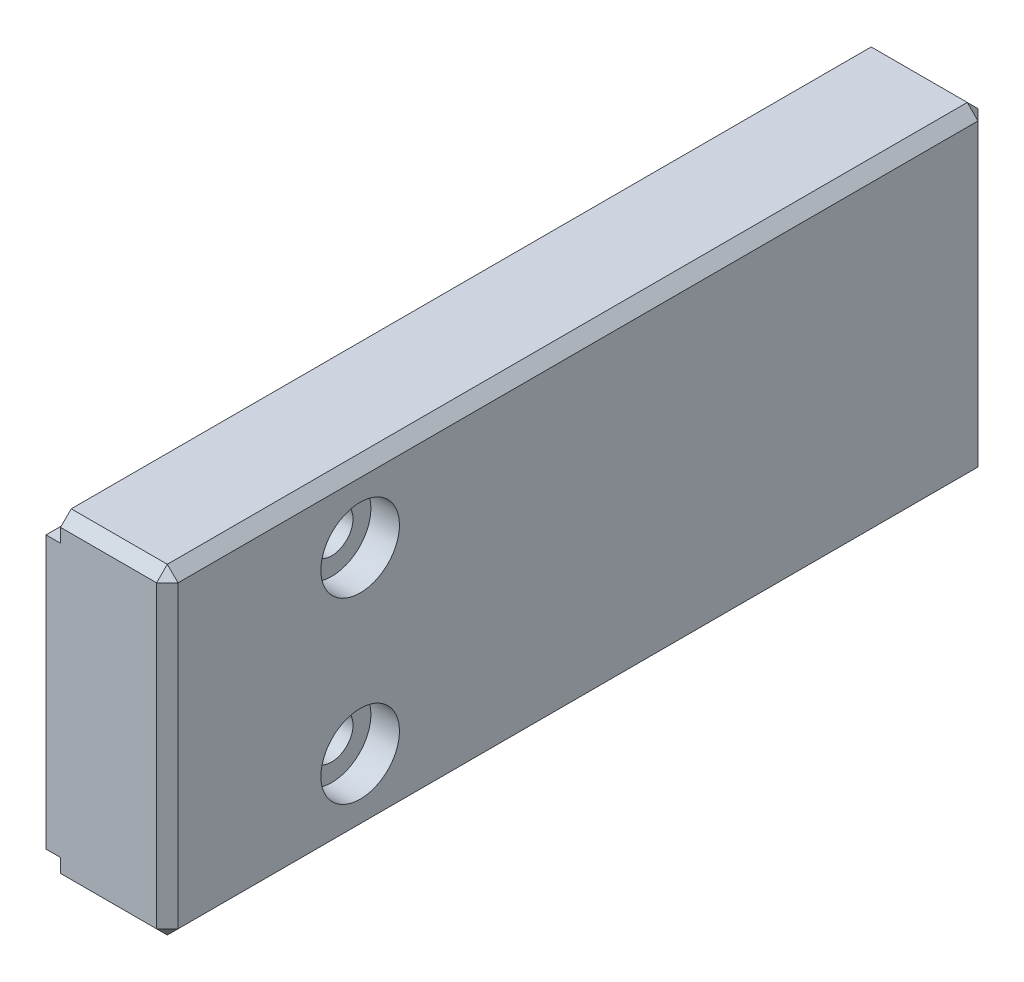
ISO-10303-21;
HEADER;
FILE_DESCRIPTION(('STEP AP214'),'2;1');
FILE_NAME('part.step','',(''),(''),'','','');
FILE_SCHEMA(('AUTOMOTIVE_DESIGN { 1 0 10303 214 1 1 1 1 }'));
ENDSEC;
DATA;
#1=APPLICATION_CONTEXT('core data for automotive mechanical design processes');
#2=APPLICATION_PROTOCOL_DEFINITION('international standard','automotive_design',2000,#1);
#3=PRODUCT_CONTEXT('',#1,'mechanical');
#4=PRODUCT('Part','Part','',(#3));
#5=PRODUCT_RELATED_PRODUCT_CATEGORY('part','',(#4));
#6=PRODUCT_DEFINITION_FORMATION('','',#4);
#7=PRODUCT_DEFINITION_CONTEXT('part definition',#1,'design');
#8=PRODUCT_DEFINITION('design','',#6,#7);
#9=PRODUCT_DEFINITION_SHAPE('','',#8);
#10=(LENGTH_UNIT() NAMED_UNIT(*) SI_UNIT(.MILLI.,.METRE.));
#11=(NAMED_UNIT(*) PLANE_ANGLE_UNIT() SI_UNIT($,.RADIAN.));
#12=(NAMED_UNIT(*) SI_UNIT($,.STERADIAN.) SOLID_ANGLE_UNIT());
#13=UNCERTAINTY_MEASURE_WITH_UNIT(LENGTH_MEASURE(1.E-05),#10,'distance_accuracy_value','');
#14=(GEOMETRIC_REPRESENTATION_CONTEXT(3) GLOBAL_UNCERTAINTY_ASSIGNED_CONTEXT((#13)) GLOBAL_UNIT_ASSIGNED_CONTEXT((#10,
#11,#12)) REPRESENTATION_CONTEXT('',''));
#15=CARTESIAN_POINT('',(0.,0.,0.));
#16=DIRECTION('',(0.,0.,1.));
#17=DIRECTION('',(1.,0.,0.));
#18=AXIS2_PLACEMENT_3D('',#15,#16,#17);
#19=CARTESIAN_POINT('',(-2.03200000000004,7.621,-40.512));
#20=DIRECTION('',(1.,0.,0.));
#21=DIRECTION('',(0.,0.,-1.));
#22=AXIS2_PLACEMENT_3D('',#19,#20,#21);
#23=CYLINDRICAL_SURFACE('',#22,8.00000000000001);
#24=DIRECTION('',(1.,0.,0.));
#25=VECTOR('',#24,1.);
#26=CARTESIAN_POINT('',(-2.03200000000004,7.621,-32.512));
#27=LINE('',#26,#25);
#28=CARTESIAN_POINT('',(7.96799999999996,7.621,-32.512));
#29=VERTEX_POINT('',#28);
#30=CARTESIAN_POINT('',(-2.03200000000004,7.621,-32.512));
#31=VERTEX_POINT('',#30);
#32=EDGE_CURVE('E156',#29,#31,#27,.F.);
#33=ORIENTED_EDGE('',*,*,#32,.T.);
#34=CARTESIAN_POINT('',(-2.03200000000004,7.621,-40.512));
#35=DIRECTION('',(1.,0.,0.));
#36=DIRECTION('',(0.,0.,-1.));
#37=AXIS2_PLACEMENT_3D('',#34,#35,#36);
#38=CIRCLE('',#37,8.00000000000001);
#39=CARTESIAN_POINT('',(-2.03200000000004,15.621,-40.512));
#40=VERTEX_POINT('',#39);
#41=EDGE_CURVE('E237',#40,#31,#38,.T.);
#42=ORIENTED_EDGE('',*,*,#41,.F.);
#43=DIRECTION('',(1.,0.,0.));
#44=VECTOR('',#43,1.);
#45=CARTESIAN_POINT('',(-2.03200000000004,15.621,-40.512));
#46=LINE('',#45,#44);
#47=CARTESIAN_POINT('',(7.96799999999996,15.621,-40.512));
#48=VERTEX_POINT('',#47);
#49=EDGE_CURVE('E152',#40,#48,#46,.T.);
#50=ORIENTED_EDGE('',*,*,#49,.T.);
#51=CARTESIAN_POINT('',(7.96799999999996,7.621,-40.512));
#52=DIRECTION('',(1.,0.,0.));
#53=DIRECTION('',(0.,0.,-1.));
#54=AXIS2_PLACEMENT_3D('',#51,#52,#53);
#55=CIRCLE('',#54,8.00000000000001);
#56=EDGE_CURVE('E20',#48,#29,#55,.T.);
#57=ORIENTED_EDGE('',*,*,#56,.T.);
#58=EDGE_LOOP('',(#33,#42,#50,#57));
#59=FACE_BOUND('',#58,.T.);
#60=ADVANCED_FACE('F16',(#59),#23,.F.);
#61=CARTESIAN_POINT('',(-2.03200000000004,-7.621,-32.512));
#62=DIRECTION('',(0.,0.,1.));
#63=DIRECTION('',(1.,0.,0.));
#64=AXIS2_PLACEMENT_3D('',#61,#62,#63);
#65=PLANE('',#64);
#66=DIRECTION('',(1.,0.,0.));
#67=VECTOR('',#66,1.);
#68=CARTESIAN_POINT('',(-2.03200000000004,-7.621,-32.512));
#69=LINE('',#68,#67);
#70=CARTESIAN_POINT('',(7.96799999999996,-7.621,-32.512));
#71=VERTEX_POINT('',#70);
#72=CARTESIAN_POINT('',(-2.03200000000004,-7.621,-32.512));
#73=VERTEX_POINT('',#72);
#74=EDGE_CURVE('E169',#71,#73,#69,.F.);
#75=ORIENTED_EDGE('',*,*,#74,.T.);
#76=DIRECTION('',(0.,1.,0.));
#77=VECTOR('',#76,1.);
#78=CARTESIAN_POINT('',(-2.03200000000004,-4.191,-32.512));
#79=LINE('',#78,#77);
#80=EDGE_CURVE('E167',#31,#73,#79,.F.);
#81=ORIENTED_EDGE('',*,*,#80,.F.);
#82=ORIENTED_EDGE('',*,*,#32,.F.);
#83=DIRECTION('',(0.,1.,0.));
#84=VECTOR('',#83,1.);
#85=CARTESIAN_POINT('',(7.96799999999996,0.,-32.512));
#86=LINE('',#85,#84);
#87=EDGE_CURVE('E161',#29,#71,#86,.F.);
#88=ORIENTED_EDGE('',*,*,#87,.T.);
#89=EDGE_LOOP('',(#75,#81,#82,#88));
#90=FACE_BOUND('',#89,.T.);
#91=ADVANCED_FACE('F164',(#90),#65,.F.);
#92=CARTESIAN_POINT('',(-2.03200000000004,-7.621,-40.512));
#93=DIRECTION('',(1.,0.,0.));
#94=DIRECTION('',(0.,0.,-1.));
#95=AXIS2_PLACEMENT_3D('',#92,#93,#94);
#96=CYLINDRICAL_SURFACE('',#95,8.);
#97=DIRECTION('',(1.,0.,0.));
#98=VECTOR('',#97,1.);
#99=CARTESIAN_POINT('',(-2.03200000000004,-15.621,-40.512));
#100=LINE('',#99,#98);
#101=CARTESIAN_POINT('',(7.96799999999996,-15.621,-40.512));
#102=VERTEX_POINT('',#101);
#103=CARTESIAN_POINT('',(-2.03200000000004,-15.621,-40.512));
#104=VERTEX_POINT('',#103);
#105=EDGE_CURVE('E176',#102,#104,#100,.F.);
#106=ORIENTED_EDGE('',*,*,#105,.T.);
#107=CARTESIAN_POINT('',(-2.03200000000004,-7.621,-40.512));
#108=DIRECTION('',(1.,0.,0.));
#109=DIRECTION('',(0.,0.,-1.));
#110=AXIS2_PLACEMENT_3D('',#107,#108,#109);
#111=CIRCLE('',#110,8.);
#112=EDGE_CURVE('E233',#73,#104,#111,.T.);
#113=ORIENTED_EDGE('',*,*,#112,.F.);
#114=ORIENTED_EDGE('',*,*,#74,.F.);
#115=CARTESIAN_POINT('',(7.96799999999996,-7.621,-40.512));
#116=DIRECTION('',(1.,0.,0.));
#117=DIRECTION('',(0.,0.,-1.));
#118=AXIS2_PLACEMENT_3D('',#115,#116,#117);
#119=CIRCLE('',#118,8.);
#120=EDGE_CURVE('E174',#71,#102,#119,.T.);
#121=ORIENTED_EDGE('',*,*,#120,.T.);
#122=EDGE_LOOP('',(#106,#113,#114,#121));
#123=FACE_BOUND('',#122,.T.);
#124=ADVANCED_FACE('F540',(#123),#96,.F.);
#125=CARTESIAN_POINT('',(10.7631428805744,21.729,-0.75));
#126=DIRECTION('',(0.,0.707106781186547,0.707106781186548));
#127=DIRECTION('',(0.,-0.707106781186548,0.707106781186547));
#128=AXIS2_PLACEMENT_3D('',#125,#126,#127);
#129=PLANE('',#128);
#130=DIRECTION('',(0.,-0.707106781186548,0.707106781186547));
#131=VECTOR('',#130,1.);
#132=CARTESIAN_POINT('',(13.4532,21.354,-0.375000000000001));
#133=LINE('',#132,#131);
#134=CARTESIAN_POINT('',(13.4532,22.479,-1.5));
#135=VERTEX_POINT('',#134);
#136=CARTESIAN_POINT('',(13.4532,20.979,0.));
#137=VERTEX_POINT('',#136);
#138=EDGE_CURVE('E284',#135,#137,#133,.T.);
#139=ORIENTED_EDGE('',*,*,#138,.F.);
#140=DIRECTION('',(1.,0.,0.));
#141=VECTOR('',#140,1.);
#142=CARTESIAN_POINT('',(14.9532,22.479,-1.5));
#143=LINE('',#142,#141);
#144=CARTESIAN_POINT('',(0.,22.479,-1.5));
#145=VERTEX_POINT('',#144);
#146=EDGE_CURVE('E228',#145,#135,#143,.T.);
#147=ORIENTED_EDGE('',*,*,#146,.F.);
#148=DIRECTION('',(0.,0.707106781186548,-0.707106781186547));
#149=VECTOR('',#148,1.);
#150=CARTESIAN_POINT('',(0.,20.979,0.));
#151=LINE('',#150,#149);
#152=CARTESIAN_POINT('',(0.,20.979,0.));
#153=VERTEX_POINT('',#152);
#154=EDGE_CURVE('E185',#153,#145,#151,.T.);
#155=ORIENTED_EDGE('',*,*,#154,.F.);
#156=DIRECTION('',(1.,0.,0.));
#157=VECTOR('',#156,1.);
#158=CARTESIAN_POINT('',(6.57308576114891,20.979,0.));
#159=LINE('',#158,#157);
#160=EDGE_CURVE('E287',#137,#153,#159,.F.);
#161=ORIENTED_EDGE('',*,*,#160,.F.);
#162=EDGE_LOOP('',(#139,#147,#155,#161));
#163=FACE_BOUND('',#162,.T.);
#164=ADVANCED_FACE('F432',(#163),#129,.T.);
#165=CARTESIAN_POINT('',(3.28654288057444,-21.729,-0.75));
#166=DIRECTION('',(0.,-0.707106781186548,0.707106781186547));
#167=DIRECTION('',(0.,-0.707106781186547,-0.707106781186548));
#168=AXIS2_PLACEMENT_3D('',#165,#166,#167);
#169=PLANE('',#168);
#170=DIRECTION('',(0.,-0.707106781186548,-0.707106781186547));
#171=VECTOR('',#170,1.);
#172=CARTESIAN_POINT('',(13.4532,-20.979,0.));
#173=LINE('',#172,#171);
#174=CARTESIAN_POINT('',(13.4532,-20.979,0.));
#175=VERTEX_POINT('',#174);
#176=CARTESIAN_POINT('',(13.4532,-22.479,-1.5));
#177=VERTEX_POINT('',#176);
#178=EDGE_CURVE('E308',#175,#177,#173,.T.);
#179=ORIENTED_EDGE('',*,*,#178,.F.);
#180=DIRECTION('',(1.,0.,0.));
#181=VECTOR('',#180,1.);
#182=CARTESIAN_POINT('',(6.57308576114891,-20.979,0.));
#183=LINE('',#182,#181);
#184=CARTESIAN_POINT('',(0.,-20.979,0.));
#185=VERTEX_POINT('',#184);
#186=EDGE_CURVE('E305',#185,#175,#183,.T.);
#187=ORIENTED_EDGE('',*,*,#186,.F.);
#188=DIRECTION('',(0.,0.707106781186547,0.707106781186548));
#189=VECTOR('',#188,1.);
#190=CARTESIAN_POINT('',(0.,-22.479,-1.5));
#191=LINE('',#190,#189);
#192=CARTESIAN_POINT('',(0.,-22.479,-1.5));
#193=VERTEX_POINT('',#192);
#194=EDGE_CURVE('E267',#193,#185,#191,.T.);
#195=ORIENTED_EDGE('',*,*,#194,.F.);
#196=DIRECTION('',(1.,0.,0.));
#197=VECTOR('',#196,1.);
#198=CARTESIAN_POINT('',(0.,-22.479,-1.5));
#199=LINE('',#198,#197);
#200=EDGE_CURVE('E311',#177,#193,#199,.F.);
#201=ORIENTED_EDGE('',*,*,#200,.F.);
#202=EDGE_LOOP('',(#179,#187,#195,#201));
#203=FACE_BOUND('',#202,.T.);
#204=ADVANCED_FACE('F436',(#203),#169,.T.);
#205=CARTESIAN_POINT('',(0.,22.479,0.));
#206=DIRECTION('',(-1.,0.,0.));
#207=DIRECTION('',(0.,0.,1.));
#208=AXIS2_PLACEMENT_3D('',#205,#206,#207);
#209=PLANE('',#208);
#210=DIRECTION('',(0.,0.,1.));
#211=VECTOR('',#210,1.);
#212=CARTESIAN_POINT('',(0.,19.05,0.));
#213=LINE('',#212,#211);
#214=CARTESIAN_POINT('',(0.,19.05,0.));
#215=VERTEX_POINT('',#214);
#216=CARTESIAN_POINT('',(0.,19.05,-115.));
#217=VERTEX_POINT('',#216);
#218=EDGE_CURVE('E182',#215,#217,#213,.F.);
#219=ORIENTED_EDGE('',*,*,#218,.F.);
#220=DIRECTION('',(0.,1.,0.));
#221=VECTOR('',#220,1.);
#222=CARTESIAN_POINT('',(0.,0.,0.));
#223=LINE('',#222,#221);
#224=EDGE_CURVE('E290',#153,#215,#223,.F.);
#225=ORIENTED_EDGE('',*,*,#224,.F.);
#226=ORIENTED_EDGE('',*,*,#154,.T.);
#227=DIRECTION('',(0.,0.,1.));
#228=VECTOR('',#227,1.);
#229=CARTESIAN_POINT('',(0.,22.479,0.));
#230=LINE('',#229,#228);
#231=CARTESIAN_POINT('',(0.,22.479,-113.5));
#232=VERTEX_POINT('',#231);
#233=EDGE_CURVE('E281',#232,#145,#230,.T.);
#234=ORIENTED_EDGE('',*,*,#233,.F.);
#235=DIRECTION('',(0.,0.707106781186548,0.707106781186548));
#236=VECTOR('',#235,1.);
#237=CARTESIAN_POINT('',(0.,21.729,-114.25));
#238=LINE('',#237,#236);
#239=CARTESIAN_POINT('',(0.,20.979,-115.));
#240=VERTEX_POINT('',#239);
#241=EDGE_CURVE('E232',#240,#232,#238,.T.);
#242=ORIENTED_EDGE('',*,*,#241,.F.);
#243=DIRECTION('',(0.,1.,0.));
#244=VECTOR('',#243,1.);
#245=CARTESIAN_POINT('',(0.,0.,-115.));
#246=LINE('',#245,#244);
#247=EDGE_CURVE('E325',#240,#217,#246,.F.);
#248=ORIENTED_EDGE('',*,*,#247,.T.);
#249=EDGE_LOOP('',(#219,#225,#226,#234,#242,#248));
#250=FACE_BOUND('',#249,.T.);
#251=ADVANCED_FACE('F430',(#250),#209,.T.);
#252=CARTESIAN_POINT('',(0.,19.05,0.));
#253=DIRECTION('',(0.,1.,0.));
#254=DIRECTION('',(0.,0.,1.));
#255=AXIS2_PLACEMENT_3D('',#252,#253,#254);
#256=PLANE('',#255);
#257=DIRECTION('',(1.,0.,0.));
#258=VECTOR('',#257,1.);
#259=CARTESIAN_POINT('',(6.57308576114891,19.05,0.));
#260=LINE('',#259,#258);
#261=CARTESIAN_POINT('',(-2.03200000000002,19.05,0.));
#262=VERTEX_POINT('',#261);
#263=EDGE_CURVE('E293',#215,#262,#260,.F.);
#264=ORIENTED_EDGE('',*,*,#263,.F.);
#265=ORIENTED_EDGE('',*,*,#218,.T.);
#266=DIRECTION('',(1.,0.,0.));
#267=VECTOR('',#266,1.);
#268=CARTESIAN_POINT('',(6.57308576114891,19.05,-115.));
#269=LINE('',#268,#267);
#270=CARTESIAN_POINT('',(-2.03200000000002,19.05,-115.));
#271=VERTEX_POINT('',#270);
#272=EDGE_CURVE('E202',#217,#271,#269,.F.);
#273=ORIENTED_EDGE('',*,*,#272,.T.);
#274=DIRECTION('',(0.,0.,1.));
#275=VECTOR('',#274,1.);
#276=CARTESIAN_POINT('',(-2.03200000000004,19.05,0.));
#277=LINE('',#276,#275);
#278=EDGE_CURVE('E261',#262,#271,#277,.F.);
#279=ORIENTED_EDGE('',*,*,#278,.F.);
#280=EDGE_LOOP('',(#264,#265,#273,#279));
#281=FACE_BOUND('',#280,.T.);
#282=ADVANCED_FACE('F428',(#281),#256,.T.);
#283=CARTESIAN_POINT('',(-2.03200000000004,15.621,-40.512));
#284=DIRECTION('',(0.,1.,0.));
#285=DIRECTION('',(0.,0.,1.));
#286=AXIS2_PLACEMENT_3D('',#283,#284,#285);
#287=PLANE('',#286);
#288=ORIENTED_EDGE('',*,*,#49,.F.);
#289=DIRECTION('',(0.,0.,1.));
#290=VECTOR('',#289,1.);
#291=CARTESIAN_POINT('',(-2.03200000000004,15.621,0.));
#292=LINE('',#291,#290);
#293=CARTESIAN_POINT('',(-2.03200000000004,15.621,-115.));
#294=VERTEX_POINT('',#293);
#295=EDGE_CURVE('E179',#294,#40,#292,.T.);
#296=ORIENTED_EDGE('',*,*,#295,.F.);
#297=DIRECTION('',(1.,0.,0.));
#298=VECTOR('',#297,1.);
#299=CARTESIAN_POINT('',(6.57308576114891,15.621,-115.));
#300=LINE('',#299,#298);
#301=CARTESIAN_POINT('',(7.96799999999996,15.621,-115.));
#302=VERTEX_POINT('',#301);
#303=EDGE_CURVE('E201',#294,#302,#300,.T.);
#304=ORIENTED_EDGE('',*,*,#303,.T.);
#305=DIRECTION('',(0.,0.,-1.));
#306=VECTOR('',#305,1.);
#307=CARTESIAN_POINT('',(7.96799999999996,15.621,-75.0934497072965));
#308=LINE('',#307,#306);
#309=EDGE_CURVE('E162',#302,#48,#308,.F.);
#310=ORIENTED_EDGE('',*,*,#309,.T.);
#311=EDGE_LOOP('',(#288,#296,#304,#310));
#312=FACE_BOUND('',#311,.T.);
#313=ADVANCED_FACE('F245',(#312),#287,.F.);
#314=CARTESIAN_POINT('',(7.96799999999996,0.,-75.0934497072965));
#315=DIRECTION('',(1.,0.,0.));
#316=DIRECTION('',(0.,0.,-1.));
#317=AXIS2_PLACEMENT_3D('',#314,#315,#316);
#318=PLANE('',#317);
#319=ORIENTED_EDGE('',*,*,#87,.F.);
#320=ORIENTED_EDGE('',*,*,#56,.F.);
#321=ORIENTED_EDGE('',*,*,#309,.F.);
#322=DIRECTION('',(0.,1.,0.));
#323=VECTOR('',#322,1.);
#324=CARTESIAN_POINT('',(7.96799999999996,0.,-115.));
#325=LINE('',#324,#323);
#326=CARTESIAN_POINT('',(7.96799999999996,-15.621,-115.));
#327=VERTEX_POINT('',#326);
#328=EDGE_CURVE('E193',#302,#327,#325,.F.);
#329=ORIENTED_EDGE('',*,*,#328,.T.);
#330=DIRECTION('',(0.,0.,-1.));
#331=VECTOR('',#330,1.);
#332=CARTESIAN_POINT('',(7.96799999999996,-15.621,-115.));
#333=LINE('',#332,#331);
#334=EDGE_CURVE('E189',#327,#102,#333,.F.);
#335=ORIENTED_EDGE('',*,*,#334,.T.);
#336=ORIENTED_EDGE('',*,*,#120,.F.);
#337=EDGE_LOOP('',(#319,#320,#321,#329,#335,#336));
#338=FACE_BOUND('',#337,.T.);
#339=ADVANCED_FACE('F172',(#338),#318,.F.);
#340=CARTESIAN_POINT('',(-2.03200000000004,-15.621,-115.));
#341=DIRECTION('',(0.,-1.,0.));
#342=DIRECTION('',(0.,0.,-1.));
#343=AXIS2_PLACEMENT_3D('',#340,#341,#342);
#344=PLANE('',#343);
#345=DIRECTION('',(1.,0.,0.));
#346=VECTOR('',#345,1.);
#347=CARTESIAN_POINT('',(6.57308576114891,-15.621,-115.));
#348=LINE('',#347,#346);
#349=CARTESIAN_POINT('',(-2.03200000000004,-15.621,-115.));
#350=VERTEX_POINT('',#349);
#351=EDGE_CURVE('E190',#327,#350,#348,.F.);
#352=ORIENTED_EDGE('',*,*,#351,.T.);
#353=DIRECTION('',(0.,0.,1.));
#354=VECTOR('',#353,1.);
#355=CARTESIAN_POINT('',(-2.03200000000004,-15.621,0.));
#356=LINE('',#355,#354);
#357=EDGE_CURVE('E236',#104,#350,#356,.F.);
#358=ORIENTED_EDGE('',*,*,#357,.F.);
#359=ORIENTED_EDGE('',*,*,#105,.F.);
#360=ORIENTED_EDGE('',*,*,#334,.F.);
#361=EDGE_LOOP('',(#352,#358,#359,#360));
#362=FACE_BOUND('',#361,.T.);
#363=ADVANCED_FACE('F257',(#362),#344,.F.);
#364=CARTESIAN_POINT('',(-2.03200000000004,-4.191,0.));
#365=DIRECTION('',(-1.,0.,0.));
#366=DIRECTION('',(0.,0.,1.));
#367=AXIS2_PLACEMENT_3D('',#364,#365,#366);
#368=PLANE('',#367);
#369=CARTESIAN_POINT('',(-2.03200000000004,12.5,-27.));
#370=DIRECTION('',(-1.,0.,0.));
#371=DIRECTION('',(0.,0.,1.));
#372=AXIS2_PLACEMENT_3D('',#369,#370,#371);
#373=CIRCLE('',#372,3.);
#374=CARTESIAN_POINT('',(-2.03200000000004,12.5,-24.));
#375=VERTEX_POINT('',#374);
#376=EDGE_CURVE('E229',#375,#375,#373,.F.);
#377=ORIENTED_EDGE('',*,*,#376,.T.);
#378=EDGE_LOOP('',(#377));
#379=FACE_BOUND('',#378,.T.);
#380=CARTESIAN_POINT('',(-2.03200000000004,-12.5,-27.));
#381=DIRECTION('',(-1.,0.,0.));
#382=DIRECTION('',(0.,0.,1.));
#383=AXIS2_PLACEMENT_3D('',#380,#381,#382);
#384=CIRCLE('',#383,3.);
#385=CARTESIAN_POINT('',(-2.03200000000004,-12.5,-24.));
#386=VERTEX_POINT('',#385);
#387=EDGE_CURVE('E225',#386,#386,#384,.F.);
#388=ORIENTED_EDGE('',*,*,#387,.T.);
#389=EDGE_LOOP('',(#388));
#390=FACE_BOUND('',#389,.T.);
#391=ORIENTED_EDGE('',*,*,#278,.T.);
#392=DIRECTION('',(0.,1.,0.));
#393=VECTOR('',#392,1.);
#394=CARTESIAN_POINT('',(-2.03200000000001,0.,-115.));
#395=LINE('',#394,#393);
#396=EDGE_CURVE('E198',#271,#294,#395,.F.);
#397=ORIENTED_EDGE('',*,*,#396,.T.);
#398=ORIENTED_EDGE('',*,*,#295,.T.);
#399=ORIENTED_EDGE('',*,*,#41,.T.);
#400=ORIENTED_EDGE('',*,*,#80,.T.);
#401=ORIENTED_EDGE('',*,*,#112,.T.);
#402=ORIENTED_EDGE('',*,*,#357,.T.);
#403=DIRECTION('',(0.,1.,0.));
#404=VECTOR('',#403,1.);
#405=CARTESIAN_POINT('',(-2.03200000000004,0.,-115.));
#406=LINE('',#405,#404);
#407=CARTESIAN_POINT('',(-2.03200000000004,-19.05,-115.));
#408=VERTEX_POINT('',#407);
#409=EDGE_CURVE('E192',#350,#408,#406,.F.);
#410=ORIENTED_EDGE('',*,*,#409,.T.);
#411=DIRECTION('',(0.,0.,-1.));
#412=VECTOR('',#411,1.);
#413=CARTESIAN_POINT('',(-2.03200000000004,-19.05,0.));
#414=LINE('',#413,#412);
#415=CARTESIAN_POINT('',(-2.03200000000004,-19.05,0.));
#416=VERTEX_POINT('',#415);
#417=EDGE_CURVE('E263',#416,#408,#414,.T.);
#418=ORIENTED_EDGE('',*,*,#417,.F.);
#419=DIRECTION('',(0.,1.,0.));
#420=VECTOR('',#419,1.);
#421=CARTESIAN_POINT('',(-2.03200000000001,0.,0.));
#422=LINE('',#421,#420);
#423=EDGE_CURVE('E296',#262,#416,#422,.F.);
#424=ORIENTED_EDGE('',*,*,#423,.F.);
#425=EDGE_LOOP('',(#391,#397,#398,#399,#400,#401,#402,#410,#418,#424));
#426=FACE_BOUND('',#425,.T.);
#427=ADVANCED_FACE('F241',(#379,#390,#426),#368,.T.);
#428=CARTESIAN_POINT('',(-2.03200000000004,-19.05,0.));
#429=DIRECTION('',(0.,-1.,0.));
#430=DIRECTION('',(0.,0.,-1.));
#431=AXIS2_PLACEMENT_3D('',#428,#429,#430);
#432=PLANE('',#431);
#433=DIRECTION('',(1.,0.,0.));
#434=VECTOR('',#433,1.);
#435=CARTESIAN_POINT('',(6.57308576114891,-19.05,0.));
#436=LINE('',#435,#434);
#437=CARTESIAN_POINT('',(0.,-19.05,0.));
#438=VERTEX_POINT('',#437);
#439=EDGE_CURVE('E299',#416,#438,#436,.T.);
#440=ORIENTED_EDGE('',*,*,#439,.F.);
#441=ORIENTED_EDGE('',*,*,#417,.T.);
#442=DIRECTION('',(1.,0.,0.));
#443=VECTOR('',#442,1.);
#444=CARTESIAN_POINT('',(6.57308576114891,-19.05,-115.));
#445=LINE('',#444,#443);
#446=CARTESIAN_POINT('',(0.,-19.05,-115.));
#447=VERTEX_POINT('',#446);
#448=EDGE_CURVE('E195',#408,#447,#445,.T.);
#449=ORIENTED_EDGE('',*,*,#448,.T.);
#450=DIRECTION('',(0.,0.,1.));
#451=VECTOR('',#450,1.);
#452=CARTESIAN_POINT('',(0.,-19.05,0.));
#453=LINE('',#452,#451);
#454=EDGE_CURVE('E269',#438,#447,#453,.F.);
#455=ORIENTED_EDGE('',*,*,#454,.F.);
#456=EDGE_LOOP('',(#440,#441,#449,#455));
#457=FACE_BOUND('',#456,.T.);
#458=ADVANCED_FACE('F421',(#457),#432,.T.);
#459=CARTESIAN_POINT('',(0.,-19.05,0.));
#460=DIRECTION('',(-1.,0.,0.));
#461=DIRECTION('',(0.,0.,1.));
#462=AXIS2_PLACEMENT_3D('',#459,#460,#461);
#463=PLANE('',#462);
#464=DIRECTION('',(0.,0.707106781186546,-0.707106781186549));
#465=VECTOR('',#464,1.);
#466=CARTESIAN_POINT('',(0.,-21.729,-114.25));
#467=LINE('',#466,#465);
#468=CARTESIAN_POINT('',(0.,-22.479,-113.5));
#469=VERTEX_POINT('',#468);
#470=CARTESIAN_POINT('',(0.,-20.979,-115.));
#471=VERTEX_POINT('',#470);
#472=EDGE_CURVE('E272',#469,#471,#467,.T.);
#473=ORIENTED_EDGE('',*,*,#472,.F.);
#474=DIRECTION('',(0.,0.,-1.));
#475=VECTOR('',#474,1.);
#476=CARTESIAN_POINT('',(0.,-22.479,0.));
#477=LINE('',#476,#475);
#478=EDGE_CURVE('E314',#193,#469,#477,.T.);
#479=ORIENTED_EDGE('',*,*,#478,.F.);
#480=ORIENTED_EDGE('',*,*,#194,.T.);
#481=DIRECTION('',(0.,1.,0.));
#482=VECTOR('',#481,1.);
#483=CARTESIAN_POINT('',(0.,0.,0.));
#484=LINE('',#483,#482);
#485=EDGE_CURVE('E302',#438,#185,#484,.F.);
#486=ORIENTED_EDGE('',*,*,#485,.F.);
#487=ORIENTED_EDGE('',*,*,#454,.T.);
#488=DIRECTION('',(0.,1.,0.));
#489=VECTOR('',#488,1.);
#490=CARTESIAN_POINT('',(0.,0.,-115.));
#491=LINE('',#490,#489);
#492=EDGE_CURVE('E329',#447,#471,#491,.F.);
#493=ORIENTED_EDGE('',*,*,#492,.T.);
#494=EDGE_LOOP('',(#473,#479,#480,#486,#487,#493));
#495=FACE_BOUND('',#494,.T.);
#496=ADVANCED_FACE('F417',(#495),#463,.T.);
#497=CARTESIAN_POINT('',(3.28654288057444,-21.729,-114.25));
#498=DIRECTION('',(0.,-0.707106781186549,-0.707106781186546));
#499=DIRECTION('',(0.,0.707106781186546,-0.707106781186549));
#500=AXIS2_PLACEMENT_3D('',#497,#498,#499);
#501=PLANE('',#500);
#502=DIRECTION('',(0.,0.707106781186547,-0.707106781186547));
#503=VECTOR('',#502,1.);
#504=CARTESIAN_POINT('',(13.4532,-22.479,-113.5));
#505=LINE('',#504,#503);
#506=CARTESIAN_POINT('',(13.4532,-22.479,-113.5));
#507=VERTEX_POINT('',#506);
#508=CARTESIAN_POINT('',(13.4532,-20.979,-115.));
#509=VERTEX_POINT('',#508);
#510=EDGE_CURVE('E323',#507,#509,#505,.T.);
#511=ORIENTED_EDGE('',*,*,#510,.F.);
#512=DIRECTION('',(1.,0.,0.));
#513=VECTOR('',#512,1.);
#514=CARTESIAN_POINT('',(0.,-22.479,-113.5));
#515=LINE('',#514,#513);
#516=EDGE_CURVE('E317',#469,#507,#515,.T.);
#517=ORIENTED_EDGE('',*,*,#516,.F.);
#518=ORIENTED_EDGE('',*,*,#472,.T.);
#519=DIRECTION('',(1.,0.,0.));
#520=VECTOR('',#519,1.);
#521=CARTESIAN_POINT('',(6.57308576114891,-20.979,-115.));
#522=LINE('',#521,#520);
#523=EDGE_CURVE('E331',#471,#509,#522,.T.);
#524=ORIENTED_EDGE('',*,*,#523,.T.);
#525=EDGE_LOOP('',(#511,#517,#518,#524));
#526=FACE_BOUND('',#525,.T.);
#527=ADVANCED_FACE('F414',(#526),#501,.T.);
#528=CARTESIAN_POINT('',(10.7631428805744,21.729,-114.25));
#529=DIRECTION('',(0.,0.707106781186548,-0.707106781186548));
#530=DIRECTION('',(0.,0.707106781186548,0.707106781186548));
#531=AXIS2_PLACEMENT_3D('',#528,#529,#530);
#532=PLANE('',#531);
#533=DIRECTION('',(0.,0.707106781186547,0.707106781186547));
#534=VECTOR('',#533,1.);
#535=CARTESIAN_POINT('',(13.4532,21.729,-114.25));
#536=LINE('',#535,#534);
#537=CARTESIAN_POINT('',(13.4532,20.979,-115.));
#538=VERTEX_POINT('',#537);
#539=CARTESIAN_POINT('',(13.4532,22.479,-113.5));
#540=VERTEX_POINT('',#539);
#541=EDGE_CURVE('E320',#538,#540,#536,.T.);
#542=ORIENTED_EDGE('',*,*,#541,.F.);
#543=DIRECTION('',(1.,0.,0.));
#544=VECTOR('',#543,1.);
#545=CARTESIAN_POINT('',(6.57308576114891,20.979,-115.));
#546=LINE('',#545,#544);
#547=EDGE_CURVE('E224',#538,#240,#546,.F.);
#548=ORIENTED_EDGE('',*,*,#547,.T.);
#549=ORIENTED_EDGE('',*,*,#241,.T.);
#550=DIRECTION('',(1.,0.,0.));
#551=VECTOR('',#550,1.);
#552=CARTESIAN_POINT('',(14.9532,22.479,-113.5));
#553=LINE('',#552,#551);
#554=EDGE_CURVE('E278',#540,#232,#553,.F.);
#555=ORIENTED_EDGE('',*,*,#554,.F.);
#556=EDGE_LOOP('',(#542,#548,#549,#555));
#557=FACE_BOUND('',#556,.T.);
#558=ADVANCED_FACE('F391',(#557),#532,.T.);
#559=CARTESIAN_POINT('',(14.9532,12.5,-27.));
#560=DIRECTION('',(-1.,0.,0.));
#561=DIRECTION('',(0.,0.,1.));
#562=AXIS2_PLACEMENT_3D('',#559,#560,#561);
#563=CYLINDRICAL_SURFACE('',#562,3.);
#564=ORIENTED_EDGE('',*,*,#376,.F.);
#565=EDGE_LOOP('',(#564));
#566=FACE_BOUND('',#565,.T.);
#567=CARTESIAN_POINT('',(10.9532,12.5,-27.));
#568=DIRECTION('',(-1.,0.,0.));
#569=DIRECTION('',(0.,0.,1.));
#570=AXIS2_PLACEMENT_3D('',#567,#568,#569);
#571=CIRCLE('',#570,3.);
#572=CARTESIAN_POINT('',(10.9532,12.5,-24.));
#573=VERTEX_POINT('',#572);
#574=EDGE_CURVE('E221',#573,#573,#571,.F.);
#575=ORIENTED_EDGE('',*,*,#574,.T.);
#576=EDGE_LOOP('',(#575));
#577=FACE_BOUND('',#576,.T.);
#578=ADVANCED_FACE('F569',(#566,#577),#563,.F.);
#579=CARTESIAN_POINT('',(14.9532,-12.5,-27.));
#580=DIRECTION('',(-1.,0.,0.));
#581=DIRECTION('',(0.,0.,1.));
#582=AXIS2_PLACEMENT_3D('',#579,#580,#581);
#583=CYLINDRICAL_SURFACE('',#582,3.);
#584=ORIENTED_EDGE('',*,*,#387,.F.);
#585=EDGE_LOOP('',(#584));
#586=FACE_BOUND('',#585,.T.);
#587=CARTESIAN_POINT('',(10.9532,-12.5,-27.));
#588=DIRECTION('',(-1.,0.,0.));
#589=DIRECTION('',(0.,0.,1.));
#590=AXIS2_PLACEMENT_3D('',#587,#588,#589);
#591=CIRCLE('',#590,3.);
#592=CARTESIAN_POINT('',(10.9532,-12.5,-24.));
#593=VERTEX_POINT('',#592);
#594=EDGE_CURVE('E217',#593,#593,#591,.F.);
#595=ORIENTED_EDGE('',*,*,#594,.T.);
#596=EDGE_LOOP('',(#595));
#597=FACE_BOUND('',#596,.T.);
#598=ADVANCED_FACE('F572',(#586,#597),#583,.F.);
#599=CARTESIAN_POINT('',(14.9532,22.479,0.));
#600=DIRECTION('',(0.,1.,0.));
#601=DIRECTION('',(0.,0.,1.));
#602=AXIS2_PLACEMENT_3D('',#599,#600,#601);
#603=PLANE('',#602);
#604=ORIENTED_EDGE('',*,*,#554,.T.);
#605=ORIENTED_EDGE('',*,*,#233,.T.);
#606=ORIENTED_EDGE('',*,*,#146,.T.);
#607=DIRECTION('',(0.,0.,1.));
#608=VECTOR('',#607,1.);
#609=CARTESIAN_POINT('',(13.4532,22.479,0.));
#610=LINE('',#609,#608);
#611=EDGE_CURVE('E337',#540,#135,#610,.T.);
#612=ORIENTED_EDGE('',*,*,#611,.F.);
#613=EDGE_LOOP('',(#604,#605,#606,#612));
#614=FACE_BOUND('',#613,.T.);
#615=ADVANCED_FACE('F394',(#614),#603,.T.);
#616=CARTESIAN_POINT('',(14.2032,20.979,-0.75));
#617=DIRECTION('',(0.577350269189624,0.577350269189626,0.577350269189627));
#618=DIRECTION('',(0.,-0.707106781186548,0.707106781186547));
#619=AXIS2_PLACEMENT_3D('',#616,#617,#618);
#620=PLANE('',#619);
#621=DIRECTION('',(-0.707106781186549,0.707106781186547,0.));
#622=VECTOR('',#621,1.);
#623=CARTESIAN_POINT('',(14.2032,21.729,-1.5));
#624=LINE('',#623,#622);
#625=CARTESIAN_POINT('',(14.9532,20.979,-1.5));
#626=VERTEX_POINT('',#625);
#627=EDGE_CURVE('E340',#135,#626,#624,.F.);
#628=ORIENTED_EDGE('',*,*,#627,.F.);
#629=ORIENTED_EDGE('',*,*,#138,.T.);
#630=DIRECTION('',(0.707106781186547,0.,-0.707106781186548));
#631=VECTOR('',#630,1.);
#632=CARTESIAN_POINT('',(14.2032,20.979,-0.75));
#633=LINE('',#632,#631);
#634=EDGE_CURVE('E343',#626,#137,#633,.F.);
#635=ORIENTED_EDGE('',*,*,#634,.F.);
#636=EDGE_LOOP('',(#628,#629,#635));
#637=FACE_BOUND('',#636,.T.);
#638=ADVANCED_FACE('F433',(#637),#620,.T.);
#639=CARTESIAN_POINT('',(6.57308576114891,0.,0.));
#640=DIRECTION('',(0.,0.,1.));
#641=DIRECTION('',(1.,0.,0.));
#642=AXIS2_PLACEMENT_3D('',#639,#640,#641);
#643=PLANE('',#642);
#644=ORIENTED_EDGE('',*,*,#186,.T.);
#645=DIRECTION('',(0.,1.,0.));
#646=VECTOR('',#645,1.);
#647=CARTESIAN_POINT('',(13.4532,-11.2395,0.));
#648=LINE('',#647,#646);
#649=EDGE_CURVE('E346',#137,#175,#648,.F.);
#650=ORIENTED_EDGE('',*,*,#649,.F.);
#651=ORIENTED_EDGE('',*,*,#160,.T.);
#652=ORIENTED_EDGE('',*,*,#224,.T.);
#653=ORIENTED_EDGE('',*,*,#263,.T.);
#654=ORIENTED_EDGE('',*,*,#423,.T.);
#655=ORIENTED_EDGE('',*,*,#439,.T.);
#656=ORIENTED_EDGE('',*,*,#485,.T.);
#657=EDGE_LOOP('',(#644,#650,#651,#652,#653,#654,#655,#656));
#658=FACE_BOUND('',#657,.T.);
#659=ADVANCED_FACE('F425',(#658),#643,.T.);
#660=CARTESIAN_POINT('',(13.4532,-21.729,-0.75));
#661=DIRECTION('',(0.577350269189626,-0.577350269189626,0.577350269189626));
#662=DIRECTION('',(0.707106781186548,0.707106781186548,0.));
#663=AXIS2_PLACEMENT_3D('',#660,#661,#662);
#664=PLANE('',#663);
#665=DIRECTION('',(0.707106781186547,0.,-0.707106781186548));
#666=VECTOR('',#665,1.);
#667=CARTESIAN_POINT('',(14.2032,-20.979,-0.75));
#668=LINE('',#667,#666);
#669=CARTESIAN_POINT('',(14.9532,-20.979,-1.5));
#670=VERTEX_POINT('',#669);
#671=EDGE_CURVE('E349',#175,#670,#668,.T.);
#672=ORIENTED_EDGE('',*,*,#671,.F.);
#673=ORIENTED_EDGE('',*,*,#178,.T.);
#674=DIRECTION('',(0.707106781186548,0.707106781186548,0.));
#675=VECTOR('',#674,1.);
#676=CARTESIAN_POINT('',(14.2032,-21.729,-1.5));
#677=LINE('',#676,#675);
#678=EDGE_CURVE('E354',#670,#177,#677,.F.);
#679=ORIENTED_EDGE('',*,*,#678,.F.);
#680=EDGE_LOOP('',(#672,#673,#679));
#681=FACE_BOUND('',#680,.T.);
#682=ADVANCED_FACE('F437',(#681),#664,.T.);
#683=CARTESIAN_POINT('',(0.,-22.479,0.));
#684=DIRECTION('',(0.,-1.,0.));
#685=DIRECTION('',(0.,0.,-1.));
#686=AXIS2_PLACEMENT_3D('',#683,#684,#685);
#687=PLANE('',#686);
#688=ORIENTED_EDGE('',*,*,#516,.T.);
#689=DIRECTION('',(0.,0.,1.));
#690=VECTOR('',#689,1.);
#691=CARTESIAN_POINT('',(13.4532,-22.479,0.));
#692=LINE('',#691,#690);
#693=EDGE_CURVE('E357',#177,#507,#692,.F.);
#694=ORIENTED_EDGE('',*,*,#693,.F.);
#695=ORIENTED_EDGE('',*,*,#200,.T.);
#696=ORIENTED_EDGE('',*,*,#478,.T.);
#697=EDGE_LOOP('',(#688,#694,#695,#696));
#698=FACE_BOUND('',#697,.T.);
#699=ADVANCED_FACE('F411',(#698),#687,.T.);
#700=CARTESIAN_POINT('',(14.9532,20.979,-113.5));
#701=DIRECTION('',(0.577350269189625,0.577350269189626,-0.577350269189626));
#702=DIRECTION('',(0.,0.707106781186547,0.707106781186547));
#703=AXIS2_PLACEMENT_3D('',#700,#701,#702);
#704=PLANE('',#703);
#705=DIRECTION('',(-0.707106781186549,0.707106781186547,0.));
#706=VECTOR('',#705,1.);
#707=CARTESIAN_POINT('',(14.2032,21.729,-113.5));
#708=LINE('',#707,#706);
#709=CARTESIAN_POINT('',(14.9532,20.979,-113.5));
#710=VERTEX_POINT('',#709);
#711=EDGE_CURVE('E220',#710,#540,#708,.T.);
#712=ORIENTED_EDGE('',*,*,#711,.F.);
#713=DIRECTION('',(-0.707106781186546,0.,-0.707106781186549));
#714=VECTOR('',#713,1.);
#715=CARTESIAN_POINT('',(14.2032,20.979,-114.25));
#716=LINE('',#715,#714);
#717=EDGE_CURVE('E360',#538,#710,#716,.F.);
#718=ORIENTED_EDGE('',*,*,#717,.F.);
#719=ORIENTED_EDGE('',*,*,#541,.T.);
#720=EDGE_LOOP('',(#712,#718,#719));
#721=FACE_BOUND('',#720,.T.);
#722=ADVANCED_FACE('F385',(#721),#704,.T.);
#723=CARTESIAN_POINT('',(14.2032,-21.729,-113.5));
#724=DIRECTION('',(0.577350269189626,-0.577350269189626,-0.577350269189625));
#725=DIRECTION('',(0.707106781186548,0.707106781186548,0.));
#726=AXIS2_PLACEMENT_3D('',#723,#724,#725);
#727=PLANE('',#726);
#728=DIRECTION('',(-0.707106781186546,0.,-0.707106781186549));
#729=VECTOR('',#728,1.);
#730=CARTESIAN_POINT('',(14.2032,-20.979,-114.25));
#731=LINE('',#730,#729);
#732=CARTESIAN_POINT('',(14.9532,-20.979,-113.5));
#733=VERTEX_POINT('',#732);
#734=EDGE_CURVE('E35',#733,#509,#731,.T.);
#735=ORIENTED_EDGE('',*,*,#734,.F.);
#736=DIRECTION('',(0.707106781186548,0.707106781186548,0.));
#737=VECTOR('',#736,1.);
#738=CARTESIAN_POINT('',(14.2032,-21.729,-113.5));
#739=LINE('',#738,#737);
#740=EDGE_CURVE('E352',#507,#733,#739,.T.);
#741=ORIENTED_EDGE('',*,*,#740,.F.);
#742=ORIENTED_EDGE('',*,*,#510,.T.);
#743=EDGE_LOOP('',(#735,#741,#742));
#744=FACE_BOUND('',#743,.T.);
#745=ADVANCED_FACE('F408',(#744),#727,.T.);
#746=CARTESIAN_POINT('',(6.57308576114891,0.,-115.));
#747=DIRECTION('',(0.,0.,1.));
#748=DIRECTION('',(1.,0.,0.));
#749=AXIS2_PLACEMENT_3D('',#746,#747,#748);
#750=PLANE('',#749);
#751=DIRECTION('',(0.,1.,0.));
#752=VECTOR('',#751,1.);
#753=CARTESIAN_POINT('',(13.4532,-11.2395,-115.));
#754=LINE('',#753,#752);
#755=EDGE_CURVE('E216',#509,#538,#754,.T.);
#756=ORIENTED_EDGE('',*,*,#755,.F.);
#757=ORIENTED_EDGE('',*,*,#523,.F.);
#758=ORIENTED_EDGE('',*,*,#492,.F.);
#759=ORIENTED_EDGE('',*,*,#448,.F.);
#760=ORIENTED_EDGE('',*,*,#409,.F.);
#761=ORIENTED_EDGE('',*,*,#351,.F.);
#762=ORIENTED_EDGE('',*,*,#328,.F.);
#763=ORIENTED_EDGE('',*,*,#303,.F.);
#764=ORIENTED_EDGE('',*,*,#396,.F.);
#765=ORIENTED_EDGE('',*,*,#272,.F.);
#766=ORIENTED_EDGE('',*,*,#247,.F.);
#767=ORIENTED_EDGE('',*,*,#547,.F.);
#768=EDGE_LOOP('',(#756,#757,#758,#759,#760,#761,#762,#763,#764,#765,#766,#767));
#769=FACE_BOUND('',#768,.T.);
#770=ADVANCED_FACE('F251',(#769),#750,.F.);
#771=CARTESIAN_POINT('',(10.9532,6.89,-21.39));
#772=DIRECTION('',(-1.,0.,0.));
#773=DIRECTION('',(0.,1.,0.));
#774=AXIS2_PLACEMENT_3D('',#771,#772,#773);
#775=PLANE('',#774);
#776=ORIENTED_EDGE('',*,*,#574,.F.);
#777=EDGE_LOOP('',(#776));
#778=FACE_BOUND('',#777,.T.);
#779=CARTESIAN_POINT('',(10.9532,12.5,-27.));
#780=DIRECTION('',(-1.,0.,0.));
#781=DIRECTION('',(0.,-1.,0.));
#782=AXIS2_PLACEMENT_3D('',#779,#780,#781);
#783=CIRCLE('',#782,5.50000000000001);
#784=CARTESIAN_POINT('',(10.9532,7.,-27.));
#785=VERTEX_POINT('',#784);
#786=EDGE_CURVE('E213',#785,#785,#783,.F.);
#787=ORIENTED_EDGE('',*,*,#786,.T.);
#788=EDGE_LOOP('',(#787));
#789=FACE_BOUND('',#788,.T.);
#790=ADVANCED_FACE('F468',(#778,#789),#775,.F.);
#791=CARTESIAN_POINT('',(10.9532,-18.11,-21.39));
#792=DIRECTION('',(-1.,0.,0.));
#793=DIRECTION('',(0.,1.,0.));
#794=AXIS2_PLACEMENT_3D('',#791,#792,#793);
#795=PLANE('',#794);
#796=ORIENTED_EDGE('',*,*,#594,.F.);
#797=EDGE_LOOP('',(#796));
#798=FACE_BOUND('',#797,.T.);
#799=CARTESIAN_POINT('',(10.9532,-12.5,-27.));
#800=DIRECTION('',(-1.,0.,0.));
#801=DIRECTION('',(0.,0.,1.));
#802=AXIS2_PLACEMENT_3D('',#799,#800,#801);
#803=CIRCLE('',#802,5.5);
#804=CARTESIAN_POINT('',(10.9532,-12.5,-21.5));
#805=VERTEX_POINT('',#804);
#806=EDGE_CURVE('E209',#805,#805,#803,.F.);
#807=ORIENTED_EDGE('',*,*,#806,.T.);
#808=EDGE_LOOP('',(#807));
#809=FACE_BOUND('',#808,.T.);
#810=ADVANCED_FACE('F465',(#798,#809),#795,.F.);
#811=CARTESIAN_POINT('',(14.2032,21.729,0.));
#812=DIRECTION('',(0.707106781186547,0.707106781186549,0.));
#813=DIRECTION('',(-0.707106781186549,0.707106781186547,0.));
#814=AXIS2_PLACEMENT_3D('',#811,#812,#813);
#815=PLANE('',#814);
#816=ORIENTED_EDGE('',*,*,#627,.T.);
#817=DIRECTION('',(0.,0.,-1.));
#818=VECTOR('',#817,1.);
#819=CARTESIAN_POINT('',(14.9532,20.979,0.));
#820=LINE('',#819,#818);
#821=EDGE_CURVE('E212',#710,#626,#820,.F.);
#822=ORIENTED_EDGE('',*,*,#821,.F.);
#823=ORIENTED_EDGE('',*,*,#711,.T.);
#824=ORIENTED_EDGE('',*,*,#611,.T.);
#825=EDGE_LOOP('',(#816,#822,#823,#824));
#826=FACE_BOUND('',#825,.T.);
#827=ADVANCED_FACE('F397',(#826),#815,.T.);
#828=CARTESIAN_POINT('',(14.2032,-11.2395,-0.75));
#829=DIRECTION('',(0.707106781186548,0.,0.707106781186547));
#830=DIRECTION('',(0.707106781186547,0.,-0.707106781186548));
#831=AXIS2_PLACEMENT_3D('',#828,#829,#830);
#832=PLANE('',#831);
#833=ORIENTED_EDGE('',*,*,#671,.T.);
#834=DIRECTION('',(0.,1.,0.));
#835=VECTOR('',#834,1.);
#836=CARTESIAN_POINT('',(14.9532,-22.479,-1.5));
#837=LINE('',#836,#835);
#838=EDGE_CURVE('E368',#626,#670,#837,.F.);
#839=ORIENTED_EDGE('',*,*,#838,.F.);
#840=ORIENTED_EDGE('',*,*,#634,.T.);
#841=ORIENTED_EDGE('',*,*,#649,.T.);
#842=EDGE_LOOP('',(#833,#839,#840,#841));
#843=FACE_BOUND('',#842,.T.);
#844=ADVANCED_FACE('F401',(#843),#832,.T.);
#845=CARTESIAN_POINT('',(14.2032,-21.729,0.));
#846=DIRECTION('',(0.707106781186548,-0.707106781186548,0.));
#847=DIRECTION('',(0.707106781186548,0.707106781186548,0.));
#848=AXIS2_PLACEMENT_3D('',#845,#846,#847);
#849=PLANE('',#848);
#850=ORIENTED_EDGE('',*,*,#678,.T.);
#851=ORIENTED_EDGE('',*,*,#693,.T.);
#852=ORIENTED_EDGE('',*,*,#740,.T.);
#853=DIRECTION('',(0.,0.,-1.));
#854=VECTOR('',#853,1.);
#855=CARTESIAN_POINT('',(14.9532,-20.979,0.));
#856=LINE('',#855,#854);
#857=EDGE_CURVE('E371',#670,#733,#856,.T.);
#858=ORIENTED_EDGE('',*,*,#857,.F.);
#859=EDGE_LOOP('',(#850,#851,#852,#858));
#860=FACE_BOUND('',#859,.T.);
#861=ADVANCED_FACE('F406',(#860),#849,.T.);
#862=CARTESIAN_POINT('',(14.2032,-11.2395,-114.25));
#863=DIRECTION('',(0.707106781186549,0.,-0.707106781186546));
#864=DIRECTION('',(-0.707106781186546,0.,-0.707106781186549));
#865=AXIS2_PLACEMENT_3D('',#862,#863,#864);
#866=PLANE('',#865);
#867=ORIENTED_EDGE('',*,*,#734,.T.);
#868=ORIENTED_EDGE('',*,*,#755,.T.);
#869=ORIENTED_EDGE('',*,*,#717,.T.);
#870=DIRECTION('',(0.,1.,0.));
#871=VECTOR('',#870,1.);
#872=CARTESIAN_POINT('',(14.9532,-22.479,-113.5));
#873=LINE('',#872,#871);
#874=EDGE_CURVE('E208',#733,#710,#873,.T.);
#875=ORIENTED_EDGE('',*,*,#874,.F.);
#876=EDGE_LOOP('',(#867,#868,#869,#875));
#877=FACE_BOUND('',#876,.T.);
#878=ADVANCED_FACE('F381',(#877),#866,.T.);
#879=CARTESIAN_POINT('',(14.9532,12.5,-27.));
#880=DIRECTION('',(-1.,0.,0.));
#881=DIRECTION('',(0.,-1.,0.));
#882=AXIS2_PLACEMENT_3D('',#879,#880,#881);
#883=CYLINDRICAL_SURFACE('',#882,5.50000000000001);
#884=ORIENTED_EDGE('',*,*,#786,.F.);
#885=EDGE_LOOP('',(#884));
#886=FACE_BOUND('',#885,.T.);
#887=CARTESIAN_POINT('',(14.9532,12.5,-27.));
#888=DIRECTION('',(-1.,0.,0.));
#889=DIRECTION('',(0.,-1.,0.));
#890=AXIS2_PLACEMENT_3D('',#887,#888,#889);
#891=CIRCLE('',#890,5.50000000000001);
#892=CARTESIAN_POINT('',(14.9532,7.,-27.));
#893=VERTEX_POINT('',#892);
#894=EDGE_CURVE('E26',#893,#893,#891,.T.);
#895=ORIENTED_EDGE('',*,*,#894,.F.);
#896=EDGE_LOOP('',(#895));
#897=FACE_BOUND('',#896,.T.);
#898=ADVANCED_FACE('F453',(#886,#897),#883,.F.);
#899=CARTESIAN_POINT('',(14.9532,-12.5,-27.));
#900=DIRECTION('',(-1.,0.,0.));
#901=DIRECTION('',(0.,0.,1.));
#902=AXIS2_PLACEMENT_3D('',#899,#900,#901);
#903=CYLINDRICAL_SURFACE('',#902,5.5);
#904=ORIENTED_EDGE('',*,*,#806,.F.);
#905=EDGE_LOOP('',(#904));
#906=FACE_BOUND('',#905,.T.);
#907=CARTESIAN_POINT('',(14.9532,-12.5,-27.));
#908=DIRECTION('',(-1.,0.,0.));
#909=DIRECTION('',(0.,0.,1.));
#910=AXIS2_PLACEMENT_3D('',#907,#908,#909);
#911=CIRCLE('',#910,5.5);
#912=CARTESIAN_POINT('',(14.9532,-12.5,-21.5));
#913=VERTEX_POINT('',#912);
#914=EDGE_CURVE('E11',#913,#913,#911,.T.);
#915=ORIENTED_EDGE('',*,*,#914,.F.);
#916=EDGE_LOOP('',(#915));
#917=FACE_BOUND('',#916,.T.);
#918=ADVANCED_FACE('F18',(#906,#917),#903,.F.);
#919=CARTESIAN_POINT('',(14.9532,-22.479,0.));
#920=DIRECTION('',(1.,0.,0.));
#921=DIRECTION('',(0.,0.,-1.));
#922=AXIS2_PLACEMENT_3D('',#919,#920,#921);
#923=PLANE('',#922);
#924=ORIENTED_EDGE('',*,*,#914,.T.);
#925=EDGE_LOOP('',(#924));
#926=FACE_BOUND('',#925,.T.);
#927=ORIENTED_EDGE('',*,*,#894,.T.);
#928=EDGE_LOOP('',(#927));
#929=FACE_BOUND('',#928,.T.);
#930=ORIENTED_EDGE('',*,*,#857,.T.);
#931=ORIENTED_EDGE('',*,*,#874,.T.);
#932=ORIENTED_EDGE('',*,*,#821,.T.);
#933=ORIENTED_EDGE('',*,*,#838,.T.);
#934=EDGE_LOOP('',(#930,#931,#932,#933));
#935=FACE_BOUND('',#934,.T.);
#936=ADVANCED_FACE('F377',(#926,#929,#935),#923,.T.);
#937=CLOSED_SHELL('',(#60,#91,#124,#164,#204,#251,#282,#313,#339,#363,#427,#458,#496,#527,#558,
#578,#598,#615,#638,#659,#682,#699,#722,#745,#770,#790,#810,#827,#844,#861,#878,#898,#918,#936));
#938=MANIFOLD_SOLID_BREP('B1',#937);
#939=ADVANCED_BREP_SHAPE_REPRESENTATION('',(#18,#938),#14);
#940=SHAPE_DEFINITION_REPRESENTATION(#9,#939);
ENDSEC;
END-ISO-10303-21;
